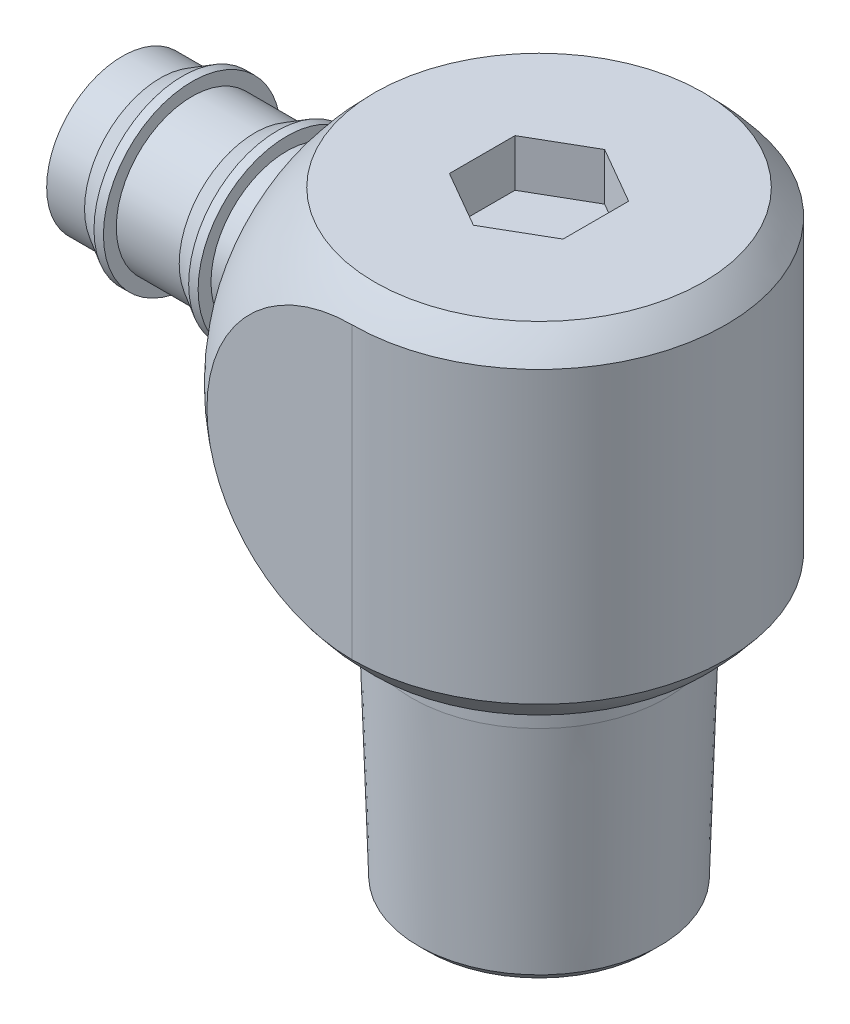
ISO-10303-21;
HEADER;
FILE_DESCRIPTION(('STEP AP214'),'2;1');
FILE_NAME('part.step','',(''),(''),'','','');
FILE_SCHEMA(('AUTOMOTIVE_DESIGN { 1 0 10303 214 1 1 1 1 }'));
ENDSEC;
DATA;
#1=APPLICATION_CONTEXT('core data for automotive mechanical design processes');
#2=APPLICATION_PROTOCOL_DEFINITION('international standard','automotive_design',2000,#1);
#3=PRODUCT_CONTEXT('',#1,'mechanical');
#4=PRODUCT('Part','Part','',(#3));
#5=PRODUCT_RELATED_PRODUCT_CATEGORY('part','',(#4));
#6=PRODUCT_DEFINITION_FORMATION('','',#4);
#7=PRODUCT_DEFINITION_CONTEXT('part definition',#1,'design');
#8=PRODUCT_DEFINITION('design','',#6,#7);
#9=PRODUCT_DEFINITION_SHAPE('','',#8);
#10=(LENGTH_UNIT() NAMED_UNIT(*) SI_UNIT(.MILLI.,.METRE.));
#11=(NAMED_UNIT(*) PLANE_ANGLE_UNIT() SI_UNIT($,.RADIAN.));
#12=(NAMED_UNIT(*) SI_UNIT($,.STERADIAN.) SOLID_ANGLE_UNIT());
#13=UNCERTAINTY_MEASURE_WITH_UNIT(LENGTH_MEASURE(1.E-05),#10,'distance_accuracy_value','');
#14=(GEOMETRIC_REPRESENTATION_CONTEXT(3) GLOBAL_UNCERTAINTY_ASSIGNED_CONTEXT((#13)) GLOBAL_UNIT_ASSIGNED_CONTEXT((#10,
#11,#12)) REPRESENTATION_CONTEXT('',''));
#15=CARTESIAN_POINT('',(0.,0.,0.));
#16=DIRECTION('',(0.,0.,1.));
#17=DIRECTION('',(1.,0.,0.));
#18=AXIS2_PLACEMENT_3D('',#15,#16,#17);
#19=CARTESIAN_POINT('',(-25.4,8.66139999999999,-15.6845));
#20=DIRECTION('',(0.,-1.,0.));
#21=DIRECTION('',(1.,0.,0.));
#22=AXIS2_PLACEMENT_3D('',#19,#20,#21);
#23=PLANE('',#22);
#24=CARTESIAN_POINT('',(0.,8.66139999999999,0.));
#25=DIRECTION('',(0.,-1.,0.));
#26=DIRECTION('',(1.,0.,0.));
#27=AXIS2_PLACEMENT_3D('',#24,#25,#26);
#28=CIRCLE('',#27,13.7710478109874);
#29=CARTESIAN_POINT('',(13.7710478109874,8.66139999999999,0.));
#30=VERTEX_POINT('',#29);
#31=EDGE_CURVE('E204',#30,#30,#28,.F.);
#32=ORIENTED_EDGE('',*,*,#31,.F.);
#33=EDGE_LOOP('',(#32));
#34=FACE_BOUND('',#33,.T.);
#35=CARTESIAN_POINT('',(0.,8.6614,0.));
#36=DIRECTION('',(0.,1.,0.));
#37=DIRECTION('',(-1.,0.,0.));
#38=AXIS2_PLACEMENT_3D('',#35,#36,#37);
#39=CIRCLE('',#38,10.668);
#40=CARTESIAN_POINT('',(-10.668,8.6614,0.));
#41=VERTEX_POINT('',#40);
#42=EDGE_CURVE('E165',#41,#41,#39,.T.);
#43=ORIENTED_EDGE('',*,*,#42,.T.);
#44=EDGE_LOOP('',(#43));
#45=FACE_BOUND('',#44,.T.);
#46=ADVANCED_FACE('F36',(#34,#45),#23,.T.);
#47=CARTESIAN_POINT('',(-15.6845,3.10515,15.6845));
#48=DIRECTION('',(1.,0.,0.));
#49=DIRECTION('',(0.,0.,-1.));
#50=AXIS2_PLACEMENT_3D('',#47,#48,#49);
#51=PLANE('',#50);
#52=CARTESIAN_POINT('',(-15.6845,22.9489,0.));
#53=DIRECTION('',(1.,0.,0.));
#54=DIRECTION('',(0.,0.,-1.));
#55=AXIS2_PLACEMENT_3D('',#52,#53,#54);
#56=CIRCLE('',#55,7.540625);
#57=CARTESIAN_POINT('',(-15.6845,22.9489,-7.540625));
#58=VERTEX_POINT('',#57);
#59=EDGE_CURVE('E12',#58,#58,#56,.T.);
#60=ORIENTED_EDGE('',*,*,#59,.T.);
#61=EDGE_LOOP('',(#60));
#62=FACE_BOUND('',#61,.T.);
#63=CARTESIAN_POINT('',(-15.6845,22.9489,0.));
#64=DIRECTION('',(1.,0.,0.));
#65=DIRECTION('',(0.,0.,-1.));
#66=AXIS2_PLACEMENT_3D('',#63,#64,#65);
#67=CIRCLE('',#66,12.156104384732);
#68=CARTESIAN_POINT('',(-15.6845,22.9489,-12.156104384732));
#69=VERTEX_POINT('',#68);
#70=EDGE_CURVE('E210',#69,#69,#67,.F.);
#71=ORIENTED_EDGE('',*,*,#70,.T.);
#72=EDGE_LOOP('',(#71));
#73=FACE_BOUND('',#72,.T.);
#74=ADVANCED_FACE('F245',(#62,#73),#51,.F.);
#75=CARTESIAN_POINT('',(0.,22.9489,0.));
#76=DIRECTION('',(0.,-1.,0.));
#77=DIRECTION('',(1.,0.,0.));
#78=AXIS2_PLACEMENT_3D('',#75,#76,#77);
#79=SPHERICAL_SURFACE('',#78,19.84375);
#80=ORIENTED_EDGE('',*,*,#31,.T.);
#81=EDGE_LOOP('',(#80));
#82=FACE_BOUND('',#81,.T.);
#83=ORIENTED_EDGE('',*,*,#70,.F.);
#84=EDGE_LOOP('',(#83));
#85=FACE_BOUND('',#84,.T.);
#86=CARTESIAN_POINT('',(0.,22.9489,-15.6845));
#87=DIRECTION('',(0.,0.,1.));
#88=DIRECTION('',(1.,0.,0.));
#89=AXIS2_PLACEMENT_3D('',#86,#87,#88);
#90=CIRCLE('',#89,12.156104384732);
#91=CARTESIAN_POINT('',(0.,10.792795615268,-15.6845));
#92=VERTEX_POINT('',#91);
#93=CARTESIAN_POINT('',(0.,35.105004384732,-15.6845));
#94=VERTEX_POINT('',#93);
#95=EDGE_CURVE('E217',#92,#94,#90,.F.);
#96=ORIENTED_EDGE('',*,*,#95,.F.);
#97=CARTESIAN_POINT('',(0.,10.792795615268,0.));
#98=DIRECTION('',(0.,1.,0.));
#99=DIRECTION('',(0.,0.,1.));
#100=AXIS2_PLACEMENT_3D('',#97,#98,#99);
#101=CIRCLE('',#100,15.6845);
#102=CARTESIAN_POINT('',(0.,10.792795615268,15.6845));
#103=VERTEX_POINT('',#102);
#104=EDGE_CURVE('E215',#103,#92,#101,.T.);
#105=ORIENTED_EDGE('',*,*,#104,.F.);
#106=CARTESIAN_POINT('',(0.,22.9489,15.6845));
#107=DIRECTION('',(0.,0.,-1.));
#108=DIRECTION('',(-1.,0.,0.));
#109=AXIS2_PLACEMENT_3D('',#106,#107,#108);
#110=CIRCLE('',#109,12.156104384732);
#111=CARTESIAN_POINT('',(0.,35.105004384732,15.6845));
#112=VERTEX_POINT('',#111);
#113=EDGE_CURVE('E211',#112,#103,#110,.F.);
#114=ORIENTED_EDGE('',*,*,#113,.F.);
#115=CARTESIAN_POINT('',(0.,35.105004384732,0.));
#116=DIRECTION('',(0.,-1.,0.));
#117=DIRECTION('',(0.,0.,-1.));
#118=AXIS2_PLACEMENT_3D('',#115,#116,#117);
#119=CIRCLE('',#118,15.6845);
#120=EDGE_CURVE('E213',#94,#112,#119,.T.);
#121=ORIENTED_EDGE('',*,*,#120,.F.);
#122=EDGE_LOOP('',(#96,#105,#114,#121));
#123=FACE_BOUND('',#122,.T.);
#124=CARTESIAN_POINT('',(0.,37.2364,0.));
#125=DIRECTION('',(0.,1.,0.));
#126=DIRECTION('',(-1.,0.,0.));
#127=AXIS2_PLACEMENT_3D('',#124,#125,#126);
#128=CIRCLE('',#127,13.7710478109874);
#129=CARTESIAN_POINT('',(-13.7710478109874,37.2364,0.));
#130=VERTEX_POINT('',#129);
#131=EDGE_CURVE('E207',#130,#130,#128,.F.);
#132=ORIENTED_EDGE('',*,*,#131,.T.);
#133=EDGE_LOOP('',(#132));
#134=FACE_BOUND('',#133,.T.);
#135=ADVANCED_FACE('F251',(#82,#85,#123,#134),#79,.T.);
#136=CARTESIAN_POINT('',(0.,3.10515,-15.6845));
#137=DIRECTION('',(0.,0.,1.));
#138=DIRECTION('',(1.,0.,0.));
#139=AXIS2_PLACEMENT_3D('',#136,#137,#138);
#140=PLANE('',#139);
#141=ORIENTED_EDGE('',*,*,#95,.T.);
#142=DIRECTION('',(0.,-1.,0.));
#143=VECTOR('',#142,1.);
#144=CARTESIAN_POINT('',(0.,3.10515,-15.6845));
#145=LINE('',#144,#143);
#146=EDGE_CURVE('E206',#94,#92,#145,.T.);
#147=ORIENTED_EDGE('',*,*,#146,.T.);
#148=EDGE_LOOP('',(#141,#147));
#149=FACE_BOUND('',#148,.T.);
#150=ADVANCED_FACE('F263',(#149),#140,.F.);
#151=CARTESIAN_POINT('',(0.,3.10515,15.6845));
#152=DIRECTION('',(0.,0.,-1.));
#153=DIRECTION('',(-1.,0.,0.));
#154=AXIS2_PLACEMENT_3D('',#151,#152,#153);
#155=PLANE('',#154);
#156=ORIENTED_EDGE('',*,*,#113,.T.);
#157=DIRECTION('',(0.,-1.,0.));
#158=VECTOR('',#157,1.);
#159=CARTESIAN_POINT('',(0.,3.10515,15.6845));
#160=LINE('',#159,#158);
#161=EDGE_CURVE('E58',#112,#103,#160,.T.);
#162=ORIENTED_EDGE('',*,*,#161,.F.);
#163=EDGE_LOOP('',(#156,#162));
#164=FACE_BOUND('',#163,.T.);
#165=ADVANCED_FACE('F260',(#164),#155,.F.);
#166=CARTESIAN_POINT('',(0.,3.10515,0.));
#167=DIRECTION('',(0.,-1.,0.));
#168=DIRECTION('',(0.,0.,-1.));
#169=AXIS2_PLACEMENT_3D('',#166,#167,#168);
#170=CYLINDRICAL_SURFACE('',#169,15.6845);
#171=ORIENTED_EDGE('',*,*,#104,.T.);
#172=ORIENTED_EDGE('',*,*,#146,.F.);
#173=ORIENTED_EDGE('',*,*,#120,.T.);
#174=ORIENTED_EDGE('',*,*,#161,.T.);
#175=EDGE_LOOP('',(#171,#172,#173,#174));
#176=FACE_BOUND('',#175,.T.);
#177=ADVANCED_FACE('F262',(#176),#170,.T.);
#178=CARTESIAN_POINT('',(-25.4,37.2364,-15.6845));
#179=DIRECTION('',(0.,1.,0.));
#180=DIRECTION('',(-1.,0.,0.));
#181=AXIS2_PLACEMENT_3D('',#178,#179,#180);
#182=PLANE('',#181);
#183=DIRECTION('',(0.866025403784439,0.,0.5));
#184=VECTOR('',#183,1.);
#185=CARTESIAN_POINT('',(-4.76249999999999,37.2364,2.74963065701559));
#186=LINE('',#185,#184);
#187=CARTESIAN_POINT('',(-4.76249999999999,37.2364,2.74963065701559));
#188=VERTEX_POINT('',#187);
#189=CARTESIAN_POINT('',(0.,37.2364,5.49926131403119));
#190=VERTEX_POINT('',#189);
#191=EDGE_CURVE('E51',#188,#190,#186,.T.);
#192=ORIENTED_EDGE('',*,*,#191,.F.);
#193=DIRECTION('',(0.,0.,1.));
#194=VECTOR('',#193,1.);
#195=CARTESIAN_POINT('',(-4.76249999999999,37.2364,-2.74963065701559));
#196=LINE('',#195,#194);
#197=CARTESIAN_POINT('',(-4.76249999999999,37.2364,-2.74963065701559));
#198=VERTEX_POINT('',#197);
#199=EDGE_CURVE('E122',#198,#188,#196,.T.);
#200=ORIENTED_EDGE('',*,*,#199,.F.);
#201=DIRECTION('',(-0.866025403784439,0.,0.5));
#202=VECTOR('',#201,1.);
#203=CARTESIAN_POINT('',(0.,37.2364,-5.49926131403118));
#204=LINE('',#203,#202);
#205=CARTESIAN_POINT('',(0.,37.2364,-5.49926131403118));
#206=VERTEX_POINT('',#205);
#207=EDGE_CURVE('E125',#206,#198,#204,.T.);
#208=ORIENTED_EDGE('',*,*,#207,.F.);
#209=DIRECTION('',(-0.866025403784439,0.,-0.5));
#210=VECTOR('',#209,1.);
#211=CARTESIAN_POINT('',(4.7625,37.2364,-2.74963065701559));
#212=LINE('',#211,#210);
#213=CARTESIAN_POINT('',(4.7625,37.2364,-2.74963065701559));
#214=VERTEX_POINT('',#213);
#215=EDGE_CURVE('E148',#214,#206,#212,.T.);
#216=ORIENTED_EDGE('',*,*,#215,.F.);
#217=DIRECTION('',(0.,0.,-1.));
#218=VECTOR('',#217,1.);
#219=CARTESIAN_POINT('',(4.7625,37.2364,2.74963065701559));
#220=LINE('',#219,#218);
#221=CARTESIAN_POINT('',(4.7625,37.2364,2.74963065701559));
#222=VERTEX_POINT('',#221);
#223=EDGE_CURVE('E145',#222,#214,#220,.T.);
#224=ORIENTED_EDGE('',*,*,#223,.F.);
#225=DIRECTION('',(0.866025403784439,0.,-0.5));
#226=VECTOR('',#225,1.);
#227=CARTESIAN_POINT('',(0.,37.2364,5.49926131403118));
#228=LINE('',#227,#226);
#229=EDGE_CURVE('E143',#190,#222,#228,.T.);
#230=ORIENTED_EDGE('',*,*,#229,.F.);
#231=EDGE_LOOP('',(#192,#200,#208,#216,#224,#230));
#232=FACE_BOUND('',#231,.T.);
#233=ORIENTED_EDGE('',*,*,#131,.F.);
#234=EDGE_LOOP('',(#233));
#235=FACE_BOUND('',#234,.T.);
#236=ADVANCED_FACE('F258',(#232,#235),#182,.T.);
#237=CARTESIAN_POINT('',(0.,22.9489,0.));
#238=DIRECTION('',(-1.,0.,0.));
#239=DIRECTION('',(0.,0.,1.));
#240=AXIS2_PLACEMENT_3D('',#237,#238,#239);
#241=CYLINDRICAL_SURFACE('',#240,6.35);
#242=CARTESIAN_POINT('',(-16.875125,22.9489,0.));
#243=DIRECTION('',(1.,0.,0.));
#244=DIRECTION('',(0.,0.,-1.));
#245=AXIS2_PLACEMENT_3D('',#242,#243,#244);
#246=CIRCLE('',#245,6.35);
#247=CARTESIAN_POINT('',(-16.875125,22.9489,-6.35));
#248=VERTEX_POINT('',#247);
#249=EDGE_CURVE('E44',#248,#248,#246,.F.);
#250=ORIENTED_EDGE('',*,*,#249,.T.);
#251=EDGE_LOOP('',(#250));
#252=FACE_BOUND('',#251,.T.);
#253=CARTESIAN_POINT('',(-21.1490011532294,22.9489,0.));
#254=DIRECTION('',(-1.,0.,0.));
#255=DIRECTION('',(0.,0.,1.));
#256=AXIS2_PLACEMENT_3D('',#253,#254,#255);
#257=CIRCLE('',#256,6.35);
#258=CARTESIAN_POINT('',(-21.1490011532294,22.9489,6.35));
#259=VERTEX_POINT('',#258);
#260=EDGE_CURVE('E180',#259,#259,#257,.T.);
#261=ORIENTED_EDGE('',*,*,#260,.F.);
#262=EDGE_LOOP('',(#261));
#263=FACE_BOUND('',#262,.T.);
#264=ADVANCED_FACE('F227',(#252,#263),#241,.T.);
#265=CARTESIAN_POINT('',(0.,22.9489,0.));
#266=DIRECTION('',(-1.,0.,0.));
#267=DIRECTION('',(0.,0.,1.));
#268=AXIS2_PLACEMENT_3D('',#265,#266,#267);
#269=CYLINDRICAL_SURFACE('',#268,6.35);
#270=CARTESIAN_POINT('',(-34.925,22.9489,0.));
#271=DIRECTION('',(-1.,0.,0.));
#272=DIRECTION('',(0.,0.,1.));
#273=AXIS2_PLACEMENT_3D('',#270,#271,#272);
#274=CIRCLE('',#273,6.35);
#275=CARTESIAN_POINT('',(-34.925,22.9489,6.35));
#276=VERTEX_POINT('',#275);
#277=EDGE_CURVE('E177',#276,#276,#274,.T.);
#278=ORIENTED_EDGE('',*,*,#277,.F.);
#279=EDGE_LOOP('',(#278));
#280=FACE_BOUND('',#279,.T.);
#281=CARTESIAN_POINT('',(-31.75,22.9489,0.));
#282=DIRECTION('',(-1.,0.,0.));
#283=DIRECTION('',(0.,0.,1.));
#284=AXIS2_PLACEMENT_3D('',#281,#282,#283);
#285=CIRCLE('',#284,6.35);
#286=CARTESIAN_POINT('',(-31.75,22.9489,6.35));
#287=VERTEX_POINT('',#286);
#288=EDGE_CURVE('E201',#287,#287,#285,.T.);
#289=ORIENTED_EDGE('',*,*,#288,.T.);
#290=EDGE_LOOP('',(#289));
#291=FACE_BOUND('',#290,.T.);
#292=ADVANCED_FACE('F288',(#280,#291),#269,.T.);
#293=CARTESIAN_POINT('',(-29.8802511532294,22.9489,0.));
#294=DIRECTION('',(1.,0.,0.));
#295=DIRECTION('',(0.,0.,-1.));
#296=AXIS2_PLACEMENT_3D('',#293,#294,#295);
#297=CONICAL_SURFACE('',#296,7.4295,0.523598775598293);
#298=ORIENTED_EDGE('',*,*,#288,.F.);
#299=EDGE_LOOP('',(#298));
#300=FACE_BOUND('',#299,.T.);
#301=CARTESIAN_POINT('',(-29.8802511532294,22.9489,0.));
#302=DIRECTION('',(-1.,0.,0.));
#303=DIRECTION('',(0.,0.,1.));
#304=AXIS2_PLACEMENT_3D('',#301,#302,#303);
#305=CIRCLE('',#304,7.4295);
#306=CARTESIAN_POINT('',(-29.8802511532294,22.9489,7.4295));
#307=VERTEX_POINT('',#306);
#308=EDGE_CURVE('E198',#307,#307,#305,.T.);
#309=ORIENTED_EDGE('',*,*,#308,.T.);
#310=EDGE_LOOP('',(#309));
#311=FACE_BOUND('',#310,.T.);
#312=ADVANCED_FACE('F358',(#300,#311),#297,.T.);
#313=CARTESIAN_POINT('',(0.,22.9489,0.));
#314=DIRECTION('',(-1.,0.,0.));
#315=DIRECTION('',(0.,0.,1.));
#316=AXIS2_PLACEMENT_3D('',#313,#314,#315);
#317=CYLINDRICAL_SURFACE('',#316,7.4295);
#318=ORIENTED_EDGE('',*,*,#308,.F.);
#319=EDGE_LOOP('',(#318));
#320=FACE_BOUND('',#319,.T.);
#321=CARTESIAN_POINT('',(-29.0865011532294,22.9489,0.));
#322=DIRECTION('',(-1.,0.,0.));
#323=DIRECTION('',(0.,0.,1.));
#324=AXIS2_PLACEMENT_3D('',#321,#322,#323);
#325=CIRCLE('',#324,7.4295);
#326=CARTESIAN_POINT('',(-29.0865011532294,22.9489,7.4295));
#327=VERTEX_POINT('',#326);
#328=EDGE_CURVE('E195',#327,#327,#325,.T.);
#329=ORIENTED_EDGE('',*,*,#328,.T.);
#330=EDGE_LOOP('',(#329));
#331=FACE_BOUND('',#330,.T.);
#332=ADVANCED_FACE('F354',(#320,#331),#317,.T.);
#333=CARTESIAN_POINT('',(-29.0865011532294,22.9489,-7.4295));
#334=DIRECTION('',(-1.,0.,0.));
#335=DIRECTION('',(0.,0.,1.));
#336=AXIS2_PLACEMENT_3D('',#333,#334,#335);
#337=PLANE('',#336);
#338=ORIENTED_EDGE('',*,*,#328,.F.);
#339=EDGE_LOOP('',(#338));
#340=FACE_BOUND('',#339,.T.);
#341=CARTESIAN_POINT('',(-29.0865011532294,22.9489,0.));
#342=DIRECTION('',(-1.,0.,0.));
#343=DIRECTION('',(0.,0.,1.));
#344=AXIS2_PLACEMENT_3D('',#341,#342,#343);
#345=CIRCLE('',#344,6.35);
#346=CARTESIAN_POINT('',(-29.0865011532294,22.9489,6.35));
#347=VERTEX_POINT('',#346);
#348=EDGE_CURVE('E192',#347,#347,#345,.T.);
#349=ORIENTED_EDGE('',*,*,#348,.T.);
#350=EDGE_LOOP('',(#349));
#351=FACE_BOUND('',#350,.T.);
#352=ADVANCED_FACE('F350',(#340,#351),#337,.F.);
#353=CARTESIAN_POINT('',(0.,22.9489,0.));
#354=DIRECTION('',(-1.,0.,0.));
#355=DIRECTION('',(0.,0.,1.));
#356=AXIS2_PLACEMENT_3D('',#353,#354,#355);
#357=CYLINDRICAL_SURFACE('',#356,6.35);
#358=ORIENTED_EDGE('',*,*,#348,.F.);
#359=EDGE_LOOP('',(#358));
#360=FACE_BOUND('',#359,.T.);
#361=CARTESIAN_POINT('',(-23.8125,22.9489,0.));
#362=DIRECTION('',(-1.,0.,0.));
#363=DIRECTION('',(0.,0.,1.));
#364=AXIS2_PLACEMENT_3D('',#361,#362,#363);
#365=CIRCLE('',#364,6.35);
#366=CARTESIAN_POINT('',(-23.8125,22.9489,6.35));
#367=VERTEX_POINT('',#366);
#368=EDGE_CURVE('E189',#367,#367,#365,.T.);
#369=ORIENTED_EDGE('',*,*,#368,.T.);
#370=EDGE_LOOP('',(#369));
#371=FACE_BOUND('',#370,.T.);
#372=ADVANCED_FACE('F346',(#360,#371),#357,.T.);
#373=CARTESIAN_POINT('',(-21.9427511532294,22.9489,0.));
#374=DIRECTION('',(1.,0.,0.));
#375=DIRECTION('',(0.,0.,-1.));
#376=AXIS2_PLACEMENT_3D('',#373,#374,#375);
#377=CONICAL_SURFACE('',#376,7.4295,0.523598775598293);
#378=ORIENTED_EDGE('',*,*,#368,.F.);
#379=EDGE_LOOP('',(#378));
#380=FACE_BOUND('',#379,.T.);
#381=CARTESIAN_POINT('',(-21.9427511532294,22.9489,0.));
#382=DIRECTION('',(-1.,0.,0.));
#383=DIRECTION('',(0.,0.,1.));
#384=AXIS2_PLACEMENT_3D('',#381,#382,#383);
#385=CIRCLE('',#384,7.4295);
#386=CARTESIAN_POINT('',(-21.9427511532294,22.9489,7.4295));
#387=VERTEX_POINT('',#386);
#388=EDGE_CURVE('E186',#387,#387,#385,.T.);
#389=ORIENTED_EDGE('',*,*,#388,.T.);
#390=EDGE_LOOP('',(#389));
#391=FACE_BOUND('',#390,.T.);
#392=ADVANCED_FACE('F342',(#380,#391),#377,.T.);
#393=CARTESIAN_POINT('',(0.,22.9489,0.));
#394=DIRECTION('',(-1.,0.,0.));
#395=DIRECTION('',(0.,0.,1.));
#396=AXIS2_PLACEMENT_3D('',#393,#394,#395);
#397=CYLINDRICAL_SURFACE('',#396,7.4295);
#398=ORIENTED_EDGE('',*,*,#388,.F.);
#399=EDGE_LOOP('',(#398));
#400=FACE_BOUND('',#399,.T.);
#401=CARTESIAN_POINT('',(-21.1490011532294,22.9489,0.));
#402=DIRECTION('',(-1.,0.,0.));
#403=DIRECTION('',(0.,0.,1.));
#404=AXIS2_PLACEMENT_3D('',#401,#402,#403);
#405=CIRCLE('',#404,7.4295);
#406=CARTESIAN_POINT('',(-21.1490011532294,22.9489,7.4295));
#407=VERTEX_POINT('',#406);
#408=EDGE_CURVE('E183',#407,#407,#405,.T.);
#409=ORIENTED_EDGE('',*,*,#408,.T.);
#410=EDGE_LOOP('',(#409));
#411=FACE_BOUND('',#410,.T.);
#412=ADVANCED_FACE('F338',(#400,#411),#397,.T.);
#413=CARTESIAN_POINT('',(-21.1490011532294,22.9489,-7.4295));
#414=DIRECTION('',(-1.,0.,0.));
#415=DIRECTION('',(0.,0.,1.));
#416=AXIS2_PLACEMENT_3D('',#413,#414,#415);
#417=PLANE('',#416);
#418=ORIENTED_EDGE('',*,*,#408,.F.);
#419=EDGE_LOOP('',(#418));
#420=FACE_BOUND('',#419,.T.);
#421=ORIENTED_EDGE('',*,*,#260,.T.);
#422=EDGE_LOOP('',(#421));
#423=FACE_BOUND('',#422,.T.);
#424=ADVANCED_FACE('F240',(#420,#423),#417,.F.);
#425=CARTESIAN_POINT('',(-34.925,22.9489,0.));
#426=DIRECTION('',(1.,0.,0.));
#427=DIRECTION('',(0.,0.,-1.));
#428=AXIS2_PLACEMENT_3D('',#425,#426,#427);
#429=PLANE('',#428);
#430=CARTESIAN_POINT('',(-34.925,22.9489,0.));
#431=DIRECTION('',(-1.,0.,0.));
#432=DIRECTION('',(0.,0.,1.));
#433=AXIS2_PLACEMENT_3D('',#430,#431,#432);
#434=CIRCLE('',#433,5.08);
#435=CARTESIAN_POINT('',(-34.925,22.9489,5.08));
#436=VERTEX_POINT('',#435);
#437=EDGE_CURVE('E174',#436,#436,#434,.T.);
#438=ORIENTED_EDGE('',*,*,#437,.F.);
#439=EDGE_LOOP('',(#438));
#440=FACE_BOUND('',#439,.T.);
#441=ORIENTED_EDGE('',*,*,#277,.T.);
#442=EDGE_LOOP('',(#441));
#443=FACE_BOUND('',#442,.T.);
#444=ADVANCED_FACE('F232',(#440,#443),#429,.F.);
#445=CARTESIAN_POINT('',(-16.875125,22.9489,0.));
#446=DIRECTION('',(1.,0.,0.));
#447=DIRECTION('',(0.,0.,-1.));
#448=AXIS2_PLACEMENT_3D('',#445,#446,#447);
#449=TOROIDAL_SURFACE('',#448,7.540625,1.190625);
#450=ORIENTED_EDGE('',*,*,#59,.F.);
#451=EDGE_LOOP('',(#450));
#452=FACE_BOUND('',#451,.T.);
#453=ORIENTED_EDGE('',*,*,#249,.F.);
#454=EDGE_LOOP('',(#453));
#455=FACE_BOUND('',#454,.T.);
#456=ADVANCED_FACE('F38',(#452,#455),#449,.F.);
#457=CARTESIAN_POINT('',(14.3684097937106,22.9489,0.));
#458=DIRECTION('',(-1.,0.,0.));
#459=DIRECTION('',(0.,0.,1.));
#460=AXIS2_PLACEMENT_3D('',#457,#458,#459);
#461=CYLINDRICAL_SURFACE('',#460,5.08);
#462=CARTESIAN_POINT('',(-6.09897583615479,22.9489,5.08));
#463=CARTESIAN_POINT('',(-6.09897188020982,22.8233441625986,5.08000238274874));
#464=CARTESIAN_POINT('',(-6.10286710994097,22.6978110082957,5.07533844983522));
#465=CARTESIAN_POINT('',(-6.1182511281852,22.4478547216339,5.05678344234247));
#466=CARTESIAN_POINT('',(-6.12974236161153,22.3234319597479,5.04288939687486));
#467=CARTESIAN_POINT('',(-6.15981608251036,22.0766291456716,5.00610947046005));
#468=CARTESIAN_POINT('',(-6.17840816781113,21.9542520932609,4.98321141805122));
#469=CARTESIAN_POINT('',(-6.22189025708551,21.712544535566,4.92881279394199));
#470=CARTESIAN_POINT('',(-6.24678339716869,21.5932155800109,4.89730793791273));
#471=CARTESIAN_POINT('',(-6.32900437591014,21.2430710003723,4.79119816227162));
#472=CARTESIAN_POINT('',(-6.39420811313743,21.0176224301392,4.70461556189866));
#473=CARTESIAN_POINT('',(-6.53791057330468,20.5848698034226,4.50276904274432));
#474=CARTESIAN_POINT('',(-6.61641208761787,20.3775695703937,4.38749909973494));
#475=CARTESIAN_POINT('',(-6.79123627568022,19.9546525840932,4.11256282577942));
#476=CARTESIAN_POINT('',(-6.88850870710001,19.7420114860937,3.94892194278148));
#477=CARTESIAN_POINT('',(-7.08226720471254,19.3445805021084,3.58984754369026));
#478=CARTESIAN_POINT('',(-7.17875250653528,19.159815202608,3.39438627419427));
#479=CARTESIAN_POINT('',(-7.32269292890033,18.895422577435,3.06576479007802));
#480=CARTESIAN_POINT('',(-7.37322259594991,18.8050163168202,2.9424778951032));
#481=CARTESIAN_POINT('',(-7.47007025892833,18.6350465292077,2.68711198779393));
#482=CARTESIAN_POINT('',(-7.51639002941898,18.5554784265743,2.55503672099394));
#483=CARTESIAN_POINT('',(-7.60348493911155,18.4080843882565,2.282835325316));
#484=CARTESIAN_POINT('',(-7.64426291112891,18.3402524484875,2.14271336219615));
#485=CARTESIAN_POINT('',(-7.71905585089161,18.2172296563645,1.85529384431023));
#486=CARTESIAN_POINT('',(-7.75307212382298,18.1620363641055,1.70799768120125));
#487=CARTESIAN_POINT('',(-7.81005475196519,18.0703143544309,1.42329051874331));
#488=CARTESIAN_POINT('',(-7.8338076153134,18.0324320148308,1.28647253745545));
#489=CARTESIAN_POINT('',(-7.87433235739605,17.968114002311,1.00916759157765));
#490=CARTESIAN_POINT('',(-7.891105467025,17.9416763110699,0.868681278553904));
#491=CARTESIAN_POINT('',(-7.91715880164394,17.9007174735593,0.585418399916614));
#492=CARTESIAN_POINT('',(-7.92644560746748,17.8861858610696,0.442643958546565));
#493=CARTESIAN_POINT('',(-7.93725956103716,17.8692713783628,0.156090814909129));
#494=CARTESIAN_POINT('',(-7.93878767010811,17.8668870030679,0.0123122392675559));
#495=CARTESIAN_POINT('',(-7.93437684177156,17.8737811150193,-0.254548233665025));
#496=CARTESIAN_POINT('',(-7.92945954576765,17.8814638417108,-0.377692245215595));
#497=CARTESIAN_POINT('',(-7.91398314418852,17.9057154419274,-0.622782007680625));
#498=CARTESIAN_POINT('',(-7.90342236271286,17.9222869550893,-0.744727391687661));
#499=CARTESIAN_POINT('',(-7.8768987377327,17.9640941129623,-0.986483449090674));
#500=CARTESIAN_POINT('',(-7.86093772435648,17.9893268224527,-1.1062948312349));
#501=CARTESIAN_POINT('',(-7.82396670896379,18.0481383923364,-1.34307201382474));
#502=CARTESIAN_POINT('',(-7.80295475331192,18.0817204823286,-1.46003669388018));
#503=CARTESIAN_POINT('',(-7.73297039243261,18.1944440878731,-1.80558441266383));
#504=CARTESIAN_POINT('',(-7.67703114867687,18.2855911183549,-2.02898078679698));
#505=CARTESIAN_POINT('',(-7.55086887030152,18.4963483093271,-2.45729674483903));
#506=CARTESIAN_POINT('',(-7.48064283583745,18.6159644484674,-2.66221243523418));
#507=CARTESIAN_POINT('',(-7.32107204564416,18.8972699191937,-3.07586678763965));
#508=CARTESIAN_POINT('',(-7.23043168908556,19.062375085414,-3.28177832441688));
#509=CARTESIAN_POINT('',(-7.04402336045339,19.4212464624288,-3.66484374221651));
#510=CARTESIAN_POINT('',(-6.94824784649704,19.6150556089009,-3.84195369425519));
#511=CARTESIAN_POINT('',(-6.80025787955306,19.9394250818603,-4.09533825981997));
#512=CARTESIAN_POINT('',(-6.74701268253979,20.0613694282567,-4.18223555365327));
#513=CARTESIAN_POINT('',(-6.64309511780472,20.3133008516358,-4.34540410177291));
#514=CARTESIAN_POINT('',(-6.59242327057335,20.44328954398,-4.42167321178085));
#515=CARTESIAN_POINT('',(-6.49553622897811,20.7106028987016,-4.56281014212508));
#516=CARTESIAN_POINT('',(-6.44931377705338,20.8479150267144,-4.62769667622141));
#517=CARTESIAN_POINT('',(-6.36314827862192,21.1295330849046,-4.74548000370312));
#518=CARTESIAN_POINT('',(-6.3232049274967,21.2738386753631,-4.79837737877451));
#519=CARTESIAN_POINT('',(-6.26133487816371,21.5284612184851,-4.87866952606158));
#520=CARTESIAN_POINT('',(-6.23746174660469,21.6373596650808,-4.90908839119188));
#521=CARTESIAN_POINT('',(-6.1948470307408,21.8578840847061,-4.96275659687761));
#522=CARTESIAN_POINT('',(-6.17610414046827,21.9695093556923,-4.98600776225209));
#523=CARTESIAN_POINT('',(-6.14441366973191,22.1947583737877,-5.02500946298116));
#524=CARTESIAN_POINT('',(-6.13145996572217,22.3083798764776,-5.04076792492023));
#525=CARTESIAN_POINT('',(-6.11181383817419,22.5369333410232,-5.06457084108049));
#526=CARTESIAN_POINT('',(-6.10511927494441,22.6518648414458,-5.07261793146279));
#527=CARTESIAN_POINT('',(-6.09824334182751,22.8825699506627,-5.08088224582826));
#528=CARTESIAN_POINT('',(-6.09808256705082,22.9983450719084,-5.08107471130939));
#529=CARTESIAN_POINT('',(-6.10433221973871,23.2294573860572,-5.07356454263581));
#530=CARTESIAN_POINT('',(-6.11074268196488,23.3447945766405,-5.06586186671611));
#531=CARTESIAN_POINT('',(-6.12988218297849,23.5742165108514,-5.04268540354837));
#532=CARTESIAN_POINT('',(-6.14261460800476,23.6883005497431,-5.0272074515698));
#533=CARTESIAN_POINT('',(-6.17390670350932,23.9143959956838,-4.98872624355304));
#534=CARTESIAN_POINT('',(-6.19246870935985,24.0264065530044,-4.96571997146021));
#535=CARTESIAN_POINT('',(-6.25477977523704,24.3521937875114,-4.88733529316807));
#536=CARTESIAN_POINT('',(-6.30576756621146,24.5622591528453,-4.82189546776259));
#537=CARTESIAN_POINT('',(-6.42175254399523,24.9686859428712,-4.66630018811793));
#538=CARTESIAN_POINT('',(-6.48675438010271,25.1650427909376,-4.57613652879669));
#539=CARTESIAN_POINT('',(-6.63872150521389,25.5793303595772,-4.353481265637));
#540=CARTESIAN_POINT('',(-6.72749796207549,25.7940013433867,-4.21616416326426));
#541=CARTESIAN_POINT('',(-6.90888360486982,26.1997708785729,-3.91185667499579));
#542=CARTESIAN_POINT('',(-7.00149724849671,26.3908409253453,-3.74483099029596));
#543=CARTESIAN_POINT('',(-7.14596365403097,26.6738705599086,-3.45737392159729));
#544=CARTESIAN_POINT('',(-7.19899099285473,26.7743972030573,-3.34583629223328));
#545=CARTESIAN_POINT('',(-7.30244113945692,26.9656925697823,-3.11358249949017));
#546=CARTESIAN_POINT('',(-7.35286482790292,27.0564646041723,-2.99286947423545));
#547=CARTESIAN_POINT('',(-7.44975114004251,27.227479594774,-2.74282451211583));
#548=CARTESIAN_POINT('',(-7.49621622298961,27.3077291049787,-2.61349801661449));
#549=CARTESIAN_POINT('',(-7.58393469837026,27.4569151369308,-2.34681177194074));
#550=CARTESIAN_POINT('',(-7.62518955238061,27.5258548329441,-2.20945429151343));
#551=CARTESIAN_POINT('',(-7.69366703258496,27.6389535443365,-1.95577144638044));
#552=CARTESIAN_POINT('',(-7.72204594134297,27.6853111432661,-1.84073352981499));
#553=CARTESIAN_POINT('',(-7.77412311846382,27.769749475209,-1.60663785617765));
#554=CARTESIAN_POINT('',(-7.7978222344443,27.8078317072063,-1.48758083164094));
#555=CARTESIAN_POINT('',(-7.84002474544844,27.8752752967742,-1.24616510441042));
#556=CARTESIAN_POINT('',(-7.85853011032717,27.9046399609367,-1.12380767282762));
#557=CARTESIAN_POINT('',(-7.88992905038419,27.9542815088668,-0.876607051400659));
#558=CARTESIAN_POINT('',(-7.9028252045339,27.9745625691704,-0.751765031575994));
#559=CARTESIAN_POINT('',(-7.92274805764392,28.005833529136,-0.499976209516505));
#560=CARTESIAN_POINT('',(-7.92975259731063,28.0167883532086,-0.373023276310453));
#561=CARTESIAN_POINT('',(-7.93763600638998,28.0291147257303,-0.118508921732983));
#562=CARTESIAN_POINT('',(-7.93851714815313,28.0304898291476,0.00905225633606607));
#563=CARTESIAN_POINT('',(-7.93413710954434,28.0236445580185,0.263842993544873));
#564=CARTESIAN_POINT('',(-7.9288743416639,28.0154217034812,0.391072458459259));
#565=CARTESIAN_POINT('',(-7.91233514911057,27.9894992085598,0.644160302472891));
#566=CARTESIAN_POINT('',(-7.90105887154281,27.9717997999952,0.770018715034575));
#567=CARTESIAN_POINT('',(-7.87349985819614,27.928333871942,1.01294642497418));
#568=CARTESIAN_POINT('',(-7.85750767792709,27.9030342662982,1.13013262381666));
#569=CARTESIAN_POINT('',(-7.82070155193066,27.8444469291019,1.36173020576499));
#570=CARTESIAN_POINT('',(-7.79988603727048,27.811156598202,1.47614067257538));
#571=CARTESIAN_POINT('',(-7.73081286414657,27.6998362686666,1.81415999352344));
#572=CARTESIAN_POINT('',(-7.67590560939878,27.6103215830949,2.03275055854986));
#573=CARTESIAN_POINT('',(-7.54769840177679,27.3961629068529,2.46811567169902));
#574=CARTESIAN_POINT('',(-7.47332063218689,27.2693723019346,2.68349964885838));
#575=CARTESIAN_POINT('',(-7.31419173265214,26.9878832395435,3.09102224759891));
#576=CARTESIAN_POINT('',(-7.22943242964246,26.8331627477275,3.28314231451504));
#577=CARTESIAN_POINT('',(-7.04213429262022,26.4732867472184,3.66947775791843));
#578=CARTESIAN_POINT('',(-6.93885734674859,26.2640372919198,3.8595301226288));
#579=CARTESIAN_POINT('',(-6.73618094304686,25.8157241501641,4.20328283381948));
#580=CARTESIAN_POINT('',(-6.63678271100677,25.5766511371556,4.35697176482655));
#581=CARTESIAN_POINT('',(-6.4662895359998,25.1067144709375,4.60548420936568));
#582=CARTESIAN_POINT('',(-6.39318028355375,24.8793942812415,4.70553844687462));
#583=CARTESIAN_POINT('',(-6.29854845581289,24.5259486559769,4.8306235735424));
#584=CARTESIAN_POINT('',(-6.26952583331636,24.4061494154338,4.86813398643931));
#585=CARTESIAN_POINT('',(-6.21749190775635,24.1629025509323,4.93441736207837));
#586=CARTESIAN_POINT('',(-6.19447839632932,24.0394562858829,4.96319353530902));
#587=CARTESIAN_POINT('',(-6.15028364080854,23.7568056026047,5.01791624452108));
#588=CARTESIAN_POINT('',(-6.13117380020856,23.5967306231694,5.04113113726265));
#589=CARTESIAN_POINT('',(-6.1055223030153,23.274057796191,5.07217166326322));
#590=CARTESIAN_POINT('',(-6.09898095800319,23.1114598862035,5.07999691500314));
#591=CARTESIAN_POINT('',(-6.09897583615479,22.9489,5.08));
#592=B_SPLINE_CURVE_WITH_KNOTS('',3,(#462,#463,#464,#465,#466,#467,#468,#469,#470,#471,#472,
#473,#474,#475,#476,#477,#478,#479,#480,#481,#482,#483,#484,#485,#486,#487,#488,#489,#490,#491,
#492,#493,#494,#495,#496,#497,#498,#499,#500,#501,#502,#503,#504,#505,#506,#507,#508,#509,#510,
#511,#512,#513,#514,#515,#516,#517,#518,#519,#520,#521,#522,#523,#524,#525,#526,#527,#528,#529,
#530,#531,#532,#533,#534,#535,#536,#537,#538,#539,#540,#541,#542,#543,#544,#545,#546,#547,#548,
#549,#550,#551,#552,#553,#554,#555,#556,#557,#558,#559,#560,#561,#562,#563,#564,#565,#566,#567,
#568,#569,#570,#571,#572,#573,#574,#575,#576,#577,#578,#579,#580,#581,#582,#583,#584,#585,#586,
#587,#588,#589,#590,#591),.UNSPECIFIED.,.T.,.F.,(4,2,2,2,2,2,2,2,2,2,2,2,2,2,2,2,2,2,2,2,2,2,2,
2,2,2,2,2,2,2,2,2,2,2,2,2,2,2,2,2,2,2,2,2,2,2,2,2,2,2,2,2,2,2,2,2,2,2,2,2,2,2,2,2,4),(0.,
0.376483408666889,0.753088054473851,1.1302035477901,1.50750710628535,2.25463121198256,
3.0019123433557,3.85496084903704,4.70875740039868,5.19124660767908,5.67353148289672,
6.15556889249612,6.6375131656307,7.06869291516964,7.49979659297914,7.93052089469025,
8.36119182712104,8.73118907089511,9.10129625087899,9.47127812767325,9.84140333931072,
10.5811700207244,11.3210921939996,12.1551003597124,12.9903688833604,13.4666524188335,
13.9430319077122,14.418620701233,14.8941864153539,15.2405360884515,15.5867975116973,
15.9326918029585,16.27846780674,16.625333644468,16.9722013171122,17.3192549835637,
17.6664478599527,18.3412701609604,19.0163166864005,19.82299940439,20.6306470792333,
21.1078717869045,21.5849340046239,22.0616976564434,22.5383272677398,22.9196369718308,
23.3008775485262,23.6819733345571,24.0628937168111,24.4452404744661,24.8274453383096,
25.2097489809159,25.5920432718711,25.9544750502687,26.3170248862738,27.0415363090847,
27.8209029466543,28.6008871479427,29.5000196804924,30.3994341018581,31.172824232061,
31.5589465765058,31.9449268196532,32.4323560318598,32.9197973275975),.UNSPECIFIED.);
#593=CARTESIAN_POINT('',(-6.09897583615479,22.9489,5.08));
#594=VERTEX_POINT('',#593);
#595=EDGE_CURVE('E128',#594,#594,#592,.T.);
#596=ORIENTED_EDGE('',*,*,#595,.T.);
#597=EDGE_LOOP('',(#596));
#598=FACE_BOUND('',#597,.T.);
#599=ORIENTED_EDGE('',*,*,#437,.T.);
#600=EDGE_LOOP('',(#599));
#601=FACE_BOUND('',#600,.T.);
#602=ADVANCED_FACE('F231',(#598,#601),#461,.F.);
#603=CARTESIAN_POINT('',(0.,-12.8016,0.));
#604=DIRECTION('',(0.,1.,0.));
#605=DIRECTION('',(-1.,0.,0.));
#606=AXIS2_PLACEMENT_3D('',#603,#604,#605);
#607=CONICAL_SURFACE('',#606,10.0965033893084,0.0312396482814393);
#608=CARTESIAN_POINT('',(0.,5.4864,0.));
#609=DIRECTION('',(0.,1.,0.));
#610=DIRECTION('',(-1.,0.,0.));
#611=AXIS2_PLACEMENT_3D('',#608,#609,#610);
#612=CIRCLE('',#611,10.668);
#613=CARTESIAN_POINT('',(-10.668,5.48639999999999,0.));
#614=VERTEX_POINT('',#613);
#615=EDGE_CURVE('E155',#614,#614,#612,.T.);
#616=ORIENTED_EDGE('',*,*,#615,.F.);
#617=EDGE_LOOP('',(#616));
#618=FACE_BOUND('',#617,.T.);
#619=CARTESIAN_POINT('',(0.,-12.8016,0.));
#620=DIRECTION('',(0.,1.,0.));
#621=DIRECTION('',(-1.,0.,0.));
#622=AXIS2_PLACEMENT_3D('',#619,#620,#621);
#623=CIRCLE('',#622,10.0965033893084);
#624=CARTESIAN_POINT('',(-10.0965033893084,-12.8016,0.));
#625=VERTEX_POINT('',#624);
#626=EDGE_CURVE('E171',#625,#625,#623,.T.);
#627=ORIENTED_EDGE('',*,*,#626,.T.);
#628=EDGE_LOOP('',(#627));
#629=FACE_BOUND('',#628,.T.);
#630=ADVANCED_FACE('F238',(#618,#629),#607,.T.);
#631=CARTESIAN_POINT('',(0.,-13.5636,0.));
#632=DIRECTION('',(0.,1.,0.));
#633=DIRECTION('',(-1.,0.,0.));
#634=AXIS2_PLACEMENT_3D('',#631,#632,#633);
#635=CONICAL_SURFACE('',#634,9.33450338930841,0.785398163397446);
#636=ORIENTED_EDGE('',*,*,#626,.F.);
#637=EDGE_LOOP('',(#636));
#638=FACE_BOUND('',#637,.T.);
#639=CARTESIAN_POINT('',(0.,-13.5636,0.));
#640=DIRECTION('',(0.,1.,0.));
#641=DIRECTION('',(-1.,0.,0.));
#642=AXIS2_PLACEMENT_3D('',#639,#640,#641);
#643=CIRCLE('',#642,9.33450338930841);
#644=CARTESIAN_POINT('',(-9.33450338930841,-13.5636,0.));
#645=VERTEX_POINT('',#644);
#646=EDGE_CURVE('E168',#645,#645,#643,.T.);
#647=ORIENTED_EDGE('',*,*,#646,.T.);
#648=EDGE_LOOP('',(#647));
#649=FACE_BOUND('',#648,.T.);
#650=ADVANCED_FACE('F327',(#638,#649),#635,.T.);
#651=CARTESIAN_POINT('',(0.,-13.5636,0.));
#652=DIRECTION('',(0.,1.,0.));
#653=DIRECTION('',(-1.,0.,0.));
#654=AXIS2_PLACEMENT_3D('',#651,#652,#653);
#655=PLANE('',#654);
#656=CARTESIAN_POINT('',(0.,-13.5636,0.));
#657=DIRECTION('',(0.,-1.,0.));
#658=DIRECTION('',(1.,0.,0.));
#659=AXIS2_PLACEMENT_3D('',#656,#657,#658);
#660=CIRCLE('',#659,7.9375);
#661=CARTESIAN_POINT('',(7.93749999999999,-13.5636,0.));
#662=VERTEX_POINT('',#661);
#663=EDGE_CURVE('E530',#662,#662,#660,.T.);
#664=ORIENTED_EDGE('',*,*,#663,.F.);
#665=EDGE_LOOP('',(#664));
#666=FACE_BOUND('',#665,.T.);
#667=ORIENTED_EDGE('',*,*,#646,.F.);
#668=EDGE_LOOP('',(#667));
#669=FACE_BOUND('',#668,.T.);
#670=ADVANCED_FACE('F323',(#666,#669),#655,.F.);
#671=CARTESIAN_POINT('',(0.,-24.9400751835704,0.));
#672=DIRECTION('',(0.,1.,0.));
#673=DIRECTION('',(-1.,0.,0.));
#674=AXIS2_PLACEMENT_3D('',#671,#672,#673);
#675=CYLINDRICAL_SURFACE('',#674,10.668);
#676=ORIENTED_EDGE('',*,*,#42,.F.);
#677=EDGE_LOOP('',(#676));
#678=FACE_BOUND('',#677,.T.);
#679=ORIENTED_EDGE('',*,*,#615,.T.);
#680=EDGE_LOOP('',(#679));
#681=FACE_BOUND('',#680,.T.);
#682=ADVANCED_FACE('F311',(#678,#681),#675,.T.);
#683=CARTESIAN_POINT('',(-4.76249999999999,33.26765,2.74963065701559));
#684=DIRECTION('',(-0.5,0.,0.866025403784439));
#685=DIRECTION('',(0.866025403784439,0.,0.5));
#686=AXIS2_PLACEMENT_3D('',#683,#684,#685);
#687=PLANE('',#686);
#688=ORIENTED_EDGE('',*,*,#191,.T.);
#689=DIRECTION('',(0.,1.,0.));
#690=VECTOR('',#689,1.);
#691=CARTESIAN_POINT('',(0.,33.26765,5.49926131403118));
#692=LINE('',#691,#690);
#693=CARTESIAN_POINT('',(0.,33.26765,5.49926131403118));
#694=VERTEX_POINT('',#693);
#695=EDGE_CURVE('E99',#694,#190,#692,.T.);
#696=ORIENTED_EDGE('',*,*,#695,.F.);
#697=DIRECTION('',(0.866025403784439,0.,0.5));
#698=VECTOR('',#697,1.);
#699=CARTESIAN_POINT('',(-4.76249999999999,33.26765,2.74963065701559));
#700=LINE('',#699,#698);
#701=CARTESIAN_POINT('',(-4.76249999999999,33.26765,2.74963065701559));
#702=VERTEX_POINT('',#701);
#703=EDGE_CURVE('E103',#702,#694,#700,.T.);
#704=ORIENTED_EDGE('',*,*,#703,.F.);
#705=DIRECTION('',(0.,1.,0.));
#706=VECTOR('',#705,1.);
#707=CARTESIAN_POINT('',(-4.76249999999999,33.26765,2.74963065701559));
#708=LINE('',#707,#706);
#709=EDGE_CURVE('E153',#702,#188,#708,.T.);
#710=ORIENTED_EDGE('',*,*,#709,.T.);
#711=EDGE_LOOP('',(#688,#696,#704,#710));
#712=FACE_BOUND('',#711,.T.);
#713=ADVANCED_FACE('F101',(#712),#687,.F.);
#714=CARTESIAN_POINT('',(-4.76249999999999,33.26765,-2.74963065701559));
#715=DIRECTION('',(-1.,0.,0.));
#716=DIRECTION('',(0.,0.,1.));
#717=AXIS2_PLACEMENT_3D('',#714,#715,#716);
#718=PLANE('',#717);
#719=ORIENTED_EDGE('',*,*,#199,.T.);
#720=ORIENTED_EDGE('',*,*,#709,.F.);
#721=DIRECTION('',(0.,0.,1.));
#722=VECTOR('',#721,1.);
#723=CARTESIAN_POINT('',(-4.76249999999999,33.26765,-2.74963065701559));
#724=LINE('',#723,#722);
#725=CARTESIAN_POINT('',(-4.76249999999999,33.26765,-2.74963065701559));
#726=VERTEX_POINT('',#725);
#727=EDGE_CURVE('E109',#726,#702,#724,.T.);
#728=ORIENTED_EDGE('',*,*,#727,.F.);
#729=DIRECTION('',(0.,1.,0.));
#730=VECTOR('',#729,1.);
#731=CARTESIAN_POINT('',(-4.76249999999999,33.26765,-2.74963065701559));
#732=LINE('',#731,#730);
#733=EDGE_CURVE('E156',#726,#198,#732,.T.);
#734=ORIENTED_EDGE('',*,*,#733,.T.);
#735=EDGE_LOOP('',(#719,#720,#728,#734));
#736=FACE_BOUND('',#735,.T.);
#737=ADVANCED_FACE('F303',(#736),#718,.F.);
#738=CARTESIAN_POINT('',(0.,33.26765,-5.49926131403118));
#739=DIRECTION('',(-0.5,0.,-0.866025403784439));
#740=DIRECTION('',(-0.866025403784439,0.,0.5));
#741=AXIS2_PLACEMENT_3D('',#738,#739,#740);
#742=PLANE('',#741);
#743=ORIENTED_EDGE('',*,*,#207,.T.);
#744=ORIENTED_EDGE('',*,*,#733,.F.);
#745=DIRECTION('',(-0.866025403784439,0.,0.5));
#746=VECTOR('',#745,1.);
#747=CARTESIAN_POINT('',(0.,33.26765,-5.49926131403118));
#748=LINE('',#747,#746);
#749=CARTESIAN_POINT('',(0.,33.26765,-5.49926131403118));
#750=VERTEX_POINT('',#749);
#751=EDGE_CURVE('E139',#750,#726,#748,.T.);
#752=ORIENTED_EDGE('',*,*,#751,.F.);
#753=DIRECTION('',(0.,1.,0.));
#754=VECTOR('',#753,1.);
#755=CARTESIAN_POINT('',(0.,33.26765,-5.49926131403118));
#756=LINE('',#755,#754);
#757=EDGE_CURVE('E158',#750,#206,#756,.T.);
#758=ORIENTED_EDGE('',*,*,#757,.T.);
#759=EDGE_LOOP('',(#743,#744,#752,#758));
#760=FACE_BOUND('',#759,.T.);
#761=ADVANCED_FACE('F301',(#760),#742,.F.);
#762=CARTESIAN_POINT('',(4.7625,33.26765,-2.74963065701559));
#763=DIRECTION('',(0.5,0.,-0.866025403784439));
#764=DIRECTION('',(-0.866025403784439,0.,-0.5));
#765=AXIS2_PLACEMENT_3D('',#762,#763,#764);
#766=PLANE('',#765);
#767=ORIENTED_EDGE('',*,*,#215,.T.);
#768=ORIENTED_EDGE('',*,*,#757,.F.);
#769=DIRECTION('',(-0.866025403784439,0.,-0.5));
#770=VECTOR('',#769,1.);
#771=CARTESIAN_POINT('',(4.7625,33.26765,-2.74963065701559));
#772=LINE('',#771,#770);
#773=CARTESIAN_POINT('',(4.7625,33.26765,-2.74963065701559));
#774=VERTEX_POINT('',#773);
#775=EDGE_CURVE('E136',#774,#750,#772,.T.);
#776=ORIENTED_EDGE('',*,*,#775,.F.);
#777=DIRECTION('',(0.,1.,0.));
#778=VECTOR('',#777,1.);
#779=CARTESIAN_POINT('',(4.7625,33.26765,-2.74963065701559));
#780=LINE('',#779,#778);
#781=EDGE_CURVE('E160',#774,#214,#780,.T.);
#782=ORIENTED_EDGE('',*,*,#781,.T.);
#783=EDGE_LOOP('',(#767,#768,#776,#782));
#784=FACE_BOUND('',#783,.T.);
#785=ADVANCED_FACE('F299',(#784),#766,.F.);
#786=CARTESIAN_POINT('',(4.7625,33.26765,2.74963065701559));
#787=DIRECTION('',(1.,0.,0.));
#788=DIRECTION('',(0.,0.,-1.));
#789=AXIS2_PLACEMENT_3D('',#786,#787,#788);
#790=PLANE('',#789);
#791=ORIENTED_EDGE('',*,*,#223,.T.);
#792=ORIENTED_EDGE('',*,*,#781,.F.);
#793=DIRECTION('',(0.,0.,-1.));
#794=VECTOR('',#793,1.);
#795=CARTESIAN_POINT('',(4.7625,33.26765,2.74963065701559));
#796=LINE('',#795,#794);
#797=CARTESIAN_POINT('',(4.7625,33.26765,2.74963065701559));
#798=VERTEX_POINT('',#797);
#799=EDGE_CURVE('E117',#798,#774,#796,.T.);
#800=ORIENTED_EDGE('',*,*,#799,.F.);
#801=DIRECTION('',(0.,1.,0.));
#802=VECTOR('',#801,1.);
#803=CARTESIAN_POINT('',(4.7625,33.26765,2.74963065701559));
#804=LINE('',#803,#802);
#805=EDGE_CURVE('E108',#798,#222,#804,.T.);
#806=ORIENTED_EDGE('',*,*,#805,.T.);
#807=EDGE_LOOP('',(#791,#792,#800,#806));
#808=FACE_BOUND('',#807,.T.);
#809=ADVANCED_FACE('F295',(#808),#790,.F.);
#810=CARTESIAN_POINT('',(0.,33.26765,5.49926131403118));
#811=DIRECTION('',(0.5,0.,0.866025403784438));
#812=DIRECTION('',(0.866025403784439,0.,-0.5));
#813=AXIS2_PLACEMENT_3D('',#810,#811,#812);
#814=PLANE('',#813);
#815=ORIENTED_EDGE('',*,*,#229,.T.);
#816=ORIENTED_EDGE('',*,*,#805,.F.);
#817=DIRECTION('',(0.866025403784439,0.,-0.5));
#818=VECTOR('',#817,1.);
#819=CARTESIAN_POINT('',(0.,33.26765,5.49926131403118));
#820=LINE('',#819,#818);
#821=EDGE_CURVE('E112',#694,#798,#820,.T.);
#822=ORIENTED_EDGE('',*,*,#821,.F.);
#823=ORIENTED_EDGE('',*,*,#695,.T.);
#824=EDGE_LOOP('',(#815,#816,#822,#823));
#825=FACE_BOUND('',#824,.T.);
#826=ADVANCED_FACE('F113',(#825),#814,.F.);
#827=CARTESIAN_POINT('',(0.,33.26765,5.49926131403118));
#828=DIRECTION('',(0.,1.,0.));
#829=DIRECTION('',(0.,0.,1.));
#830=AXIS2_PLACEMENT_3D('',#827,#828,#829);
#831=PLANE('',#830);
#832=ORIENTED_EDGE('',*,*,#703,.T.);
#833=ORIENTED_EDGE('',*,*,#821,.T.);
#834=ORIENTED_EDGE('',*,*,#799,.T.);
#835=ORIENTED_EDGE('',*,*,#775,.T.);
#836=ORIENTED_EDGE('',*,*,#751,.T.);
#837=ORIENTED_EDGE('',*,*,#727,.T.);
#838=EDGE_LOOP('',(#832,#833,#834,#835,#836,#837));
#839=FACE_BOUND('',#838,.T.);
#840=ADVANCED_FACE('F119',(#839),#831,.T.);
#841=CARTESIAN_POINT('',(0.,31.20898,0.));
#842=DIRECTION('',(0.,-1.,0.));
#843=DIRECTION('',(1.,0.,0.));
#844=AXIS2_PLACEMENT_3D('',#841,#842,#843);
#845=CYLINDRICAL_SURFACE('',#844,7.9375);
#846=ORIENTED_EDGE('',*,*,#663,.T.);
#847=EDGE_LOOP('',(#846));
#848=FACE_BOUND('',#847,.T.);
#849=CARTESIAN_POINT('',(0.,31.20898,0.));
#850=DIRECTION('',(0.,-1.,0.));
#851=DIRECTION('',(1.,0.,0.));
#852=AXIS2_PLACEMENT_3D('',#849,#850,#851);
#853=CIRCLE('',#852,7.9375);
#854=CARTESIAN_POINT('',(7.93749999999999,31.20898,0.));
#855=VERTEX_POINT('',#854);
#856=EDGE_CURVE('E528',#855,#855,#853,.T.);
#857=ORIENTED_EDGE('',*,*,#856,.F.);
#858=EDGE_LOOP('',(#857));
#859=FACE_BOUND('',#858,.T.);
#860=ORIENTED_EDGE('',*,*,#595,.F.);
#861=EDGE_LOOP('',(#860));
#862=FACE_BOUND('',#861,.T.);
#863=ADVANCED_FACE('F494',(#848,#859,#862),#845,.F.);
#864=CARTESIAN_POINT('',(0.,31.20898,0.));
#865=DIRECTION('',(0.,-1.,0.));
#866=DIRECTION('',(1.,0.,0.));
#867=AXIS2_PLACEMENT_3D('',#864,#865,#866);
#868=PLANE('',#867);
#869=ORIENTED_EDGE('',*,*,#856,.T.);
#870=EDGE_LOOP('',(#869));
#871=FACE_BOUND('',#870,.T.);
#872=ADVANCED_FACE('F512',(#871),#868,.T.);
#873=CLOSED_SHELL('',(#46,#74,#135,#150,#165,#177,#236,#264,#292,#312,#332,#352,#372,#392,#412,
#424,#444,#456,#602,#630,#650,#670,#682,#713,#737,#761,#785,#809,#826,#840,#863,#872));
#874=MANIFOLD_SOLID_BREP('B2',#873);
#875=ADVANCED_BREP_SHAPE_REPRESENTATION('',(#18,#874),#14);
#876=SHAPE_DEFINITION_REPRESENTATION(#9,#875);
ENDSEC;
END-ISO-10303-21;
